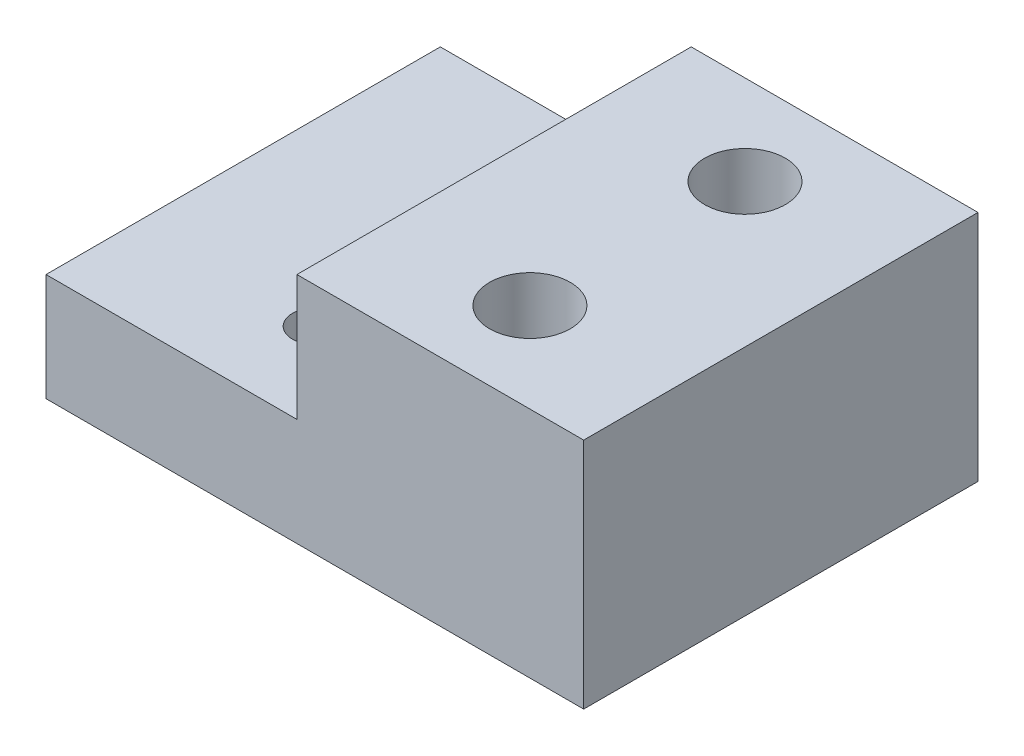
ISO-10303-21;
HEADER;
FILE_DESCRIPTION(('STEP AP214'),'2;1');
FILE_NAME('part.step','',(''),(''),'','','');
FILE_SCHEMA(('AUTOMOTIVE_DESIGN { 1 0 10303 214 1 1 1 1 }'));
ENDSEC;
DATA;
#1=APPLICATION_CONTEXT('core data for automotive mechanical design processes');
#2=APPLICATION_PROTOCOL_DEFINITION('international standard','automotive_design',2000,#1);
#3=PRODUCT_CONTEXT('',#1,'mechanical');
#4=PRODUCT('Part','Part','',(#3));
#5=PRODUCT_RELATED_PRODUCT_CATEGORY('part','',(#4));
#6=PRODUCT_DEFINITION_FORMATION('','',#4);
#7=PRODUCT_DEFINITION_CONTEXT('part definition',#1,'design');
#8=PRODUCT_DEFINITION('design','',#6,#7);
#9=PRODUCT_DEFINITION_SHAPE('','',#8);
#10=(LENGTH_UNIT() NAMED_UNIT(*) SI_UNIT(.MILLI.,.METRE.));
#11=(NAMED_UNIT(*) PLANE_ANGLE_UNIT() SI_UNIT($,.RADIAN.));
#12=(NAMED_UNIT(*) SI_UNIT($,.STERADIAN.) SOLID_ANGLE_UNIT());
#13=UNCERTAINTY_MEASURE_WITH_UNIT(LENGTH_MEASURE(1.E-05),#10,'distance_accuracy_value','');
#14=(GEOMETRIC_REPRESENTATION_CONTEXT(3) GLOBAL_UNCERTAINTY_ASSIGNED_CONTEXT((#13)) GLOBAL_UNIT_ASSIGNED_CONTEXT((#10,
#11,#12)) REPRESENTATION_CONTEXT('',''));
#15=CARTESIAN_POINT('',(0.,0.,0.));
#16=DIRECTION('',(0.,0.,1.));
#17=DIRECTION('',(1.,0.,0.));
#18=AXIS2_PLACEMENT_3D('',#15,#16,#17);
#19=CARTESIAN_POINT('',(-8.00000000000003,3.33066907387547E-13,-17.0000000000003));
#20=DIRECTION('',(0.,1.,0.));
#21=DIRECTION('',(-0.999999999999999,0.,0.));
#22=AXIS2_PLACEMENT_3D('',#19,#20,#21);
#23=CYLINDRICAL_SURFACE('',#22,2.25);
#24=CARTESIAN_POINT('',(-8.00000000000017,12.9999999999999,-17.0000000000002));
#25=DIRECTION('',(0.,1.,0.));
#26=DIRECTION('',(-0.999999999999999,0.,0.));
#27=AXIS2_PLACEMENT_3D('',#24,#25,#26);
#28=CIRCLE('',#27,2.25);
#29=CARTESIAN_POINT('',(-10.25,12.9999999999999,-17.0000000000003));
#30=VERTEX_POINT('',#29);
#31=EDGE_CURVE('E200',#30,#30,#28,.T.);
#32=CARTESIAN_POINT('',(-8.00000000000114,5.49999999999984,-17.0000000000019));
#33=DIRECTION('',(0.,-0.999999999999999,0.));
#34=DIRECTION('',(0.,0.,-0.999999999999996));
#35=AXIS2_PLACEMENT_3D('',#32,#33,#34);
#36=CIRCLE('',#35,2.25);
#37=CARTESIAN_POINT('',(-10.25,5.49999999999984,-17.0000000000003));
#38=VERTEX_POINT('',#37);
#39=EDGE_CURVE('E155',#38,#38,#36,.F.);
#40=CARTESIAN_POINT('',(-10.25,12.9999999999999,-17.0000000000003));
#41=CARTESIAN_POINT('',(-10.25,12.9218749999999,-17.0000000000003));
#42=CARTESIAN_POINT('',(-10.25,12.8437499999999,-17.0000000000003));
#43=CARTESIAN_POINT('',(-10.25,12.6874999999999,-17.0000000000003));
#44=CARTESIAN_POINT('',(-10.25,12.6093749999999,-17.0000000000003));
#45=CARTESIAN_POINT('',(-10.25,12.4531249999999,-17.0000000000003));
#46=CARTESIAN_POINT('',(-10.25,12.3749999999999,-17.0000000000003));
#47=CARTESIAN_POINT('',(-10.25,12.2187499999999,-17.0000000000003));
#48=CARTESIAN_POINT('',(-10.25,12.1406249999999,-17.0000000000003));
#49=CARTESIAN_POINT('',(-10.25,11.9843749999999,-17.0000000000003));
#50=CARTESIAN_POINT('',(-10.25,11.9062499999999,-17.0000000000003));
#51=CARTESIAN_POINT('',(-10.25,11.7499999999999,-17.0000000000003));
#52=CARTESIAN_POINT('',(-10.25,11.6718749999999,-17.0000000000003));
#53=CARTESIAN_POINT('',(-10.25,11.5156249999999,-17.0000000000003));
#54=CARTESIAN_POINT('',(-10.25,11.4374999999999,-17.0000000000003));
#55=CARTESIAN_POINT('',(-10.25,11.2812499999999,-17.0000000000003));
#56=CARTESIAN_POINT('',(-10.25,11.2031249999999,-17.0000000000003));
#57=CARTESIAN_POINT('',(-10.25,11.0468749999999,-17.0000000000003));
#58=CARTESIAN_POINT('',(-10.25,10.9687499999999,-17.0000000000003));
#59=CARTESIAN_POINT('',(-10.25,10.8124999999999,-17.0000000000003));
#60=CARTESIAN_POINT('',(-10.25,10.7343749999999,-17.0000000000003));
#61=CARTESIAN_POINT('',(-10.25,10.5781249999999,-17.0000000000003));
#62=CARTESIAN_POINT('',(-10.25,10.4999999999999,-17.0000000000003));
#63=CARTESIAN_POINT('',(-10.25,10.3437499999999,-17.0000000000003));
#64=CARTESIAN_POINT('',(-10.25,10.2656249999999,-17.0000000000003));
#65=CARTESIAN_POINT('',(-10.25,10.1093749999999,-17.0000000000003));
#66=CARTESIAN_POINT('',(-10.25,10.0312499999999,-17.0000000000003));
#67=CARTESIAN_POINT('',(-10.25,9.87499999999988,-17.0000000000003));
#68=CARTESIAN_POINT('',(-10.25,9.79687499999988,-17.0000000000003));
#69=CARTESIAN_POINT('',(-10.25,9.64062499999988,-17.0000000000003));
#70=CARTESIAN_POINT('',(-10.25,9.56249999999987,-17.0000000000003));
#71=CARTESIAN_POINT('',(-10.25,9.40624999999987,-17.0000000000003));
#72=CARTESIAN_POINT('',(-10.25,9.32812499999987,-17.0000000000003));
#73=CARTESIAN_POINT('',(-10.25,9.17187499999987,-17.0000000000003));
#74=CARTESIAN_POINT('',(-10.25,9.09374999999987,-17.0000000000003));
#75=CARTESIAN_POINT('',(-10.25,8.93749999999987,-17.0000000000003));
#76=CARTESIAN_POINT('',(-10.25,8.85937499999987,-17.0000000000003));
#77=CARTESIAN_POINT('',(-10.25,8.70312499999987,-17.0000000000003));
#78=CARTESIAN_POINT('',(-10.25,8.62499999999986,-17.0000000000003));
#79=CARTESIAN_POINT('',(-10.25,8.46874999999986,-17.0000000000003));
#80=CARTESIAN_POINT('',(-10.25,8.39062499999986,-17.0000000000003));
#81=CARTESIAN_POINT('',(-10.25,8.23437499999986,-17.0000000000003));
#82=CARTESIAN_POINT('',(-10.25,8.15624999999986,-17.0000000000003));
#83=CARTESIAN_POINT('',(-10.25,7.99999999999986,-17.0000000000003));
#84=CARTESIAN_POINT('',(-10.25,7.92187499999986,-17.0000000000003));
#85=CARTESIAN_POINT('',(-10.25,7.76562499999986,-17.0000000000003));
#86=CARTESIAN_POINT('',(-10.25,7.68749999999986,-17.0000000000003));
#87=CARTESIAN_POINT('',(-10.25,7.53124999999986,-17.0000000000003));
#88=CARTESIAN_POINT('',(-10.25,7.45312499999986,-17.0000000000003));
#89=CARTESIAN_POINT('',(-10.25,7.29687499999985,-17.0000000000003));
#90=CARTESIAN_POINT('',(-10.25,7.21874999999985,-17.0000000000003));
#91=CARTESIAN_POINT('',(-10.25,7.06249999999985,-17.0000000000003));
#92=CARTESIAN_POINT('',(-10.25,6.98437499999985,-17.0000000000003));
#93=CARTESIAN_POINT('',(-10.25,6.82812499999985,-17.0000000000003));
#94=CARTESIAN_POINT('',(-10.25,6.74999999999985,-17.0000000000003));
#95=CARTESIAN_POINT('',(-10.25,6.59374999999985,-17.0000000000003));
#96=CARTESIAN_POINT('',(-10.25,6.51562499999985,-17.0000000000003));
#97=CARTESIAN_POINT('',(-10.25,6.35937499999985,-17.0000000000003));
#98=CARTESIAN_POINT('',(-10.25,6.28124999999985,-17.0000000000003));
#99=CARTESIAN_POINT('',(-10.25,6.12499999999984,-17.0000000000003));
#100=CARTESIAN_POINT('',(-10.25,6.04687499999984,-17.0000000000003));
#101=CARTESIAN_POINT('',(-10.25,5.89062499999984,-17.0000000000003));
#102=CARTESIAN_POINT('',(-10.25,5.81249999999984,-17.0000000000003));
#103=CARTESIAN_POINT('',(-10.25,5.65624999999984,-17.0000000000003));
#104=CARTESIAN_POINT('',(-10.25,5.57812499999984,-17.0000000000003));
#105=CARTESIAN_POINT('',(-10.25,5.49999999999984,-17.0000000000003));
#106=B_SPLINE_CURVE_WITH_KNOTS('',3,(#40,#41,#42,#43,#44,#45,#46,#47,#48,#49,#50,#51,#52,#53,
#54,#55,#56,#57,#58,#59,#60,#61,#62,#63,#64,#65,#66,#67,#68,#69,#70,#71,#72,#73,#74,#75,#76,#77,
#78,#79,#80,#81,#82,#83,#84,#85,#86,#87,#88,#89,#90,#91,#92,#93,#94,#95,#96,#97,#98,#99,#100,
#101,#102,#103,#104,#105),.UNSPECIFIED.,.F.,.F.,(4,2,2,2,2,2,2,2,2,2,2,2,2,2,2,2,2,2,2,2,2,2,2,
2,2,2,2,2,2,2,2,2,4),(0.,0.234375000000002,0.468750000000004,0.703125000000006,
0.937500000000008,1.17187500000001,1.40625000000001,1.64062500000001,1.87500000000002,
2.10937500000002,2.34375000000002,2.57812500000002,2.81250000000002,3.04687500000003,
3.28125000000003,3.51562500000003,3.75000000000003,3.98437500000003,4.21875000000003,
4.45312500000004,4.68750000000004,4.92187500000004,5.15625000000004,5.39062500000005,
5.62500000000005,5.85937500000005,6.09375000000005,6.32812500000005,6.56250000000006,
6.79687500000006,7.03125000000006,7.26562500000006,7.50000000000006),.UNSPECIFIED.);
#107=EDGE_CURVE('BSEAM38',#30,#38,#106,.T.);
#108=ORIENTED_EDGE('',*,*,#31,.T.);
#109=ORIENTED_EDGE('',*,*,#39,.F.);
#110=ORIENTED_EDGE('',*,*,#107,.T.);
#111=ORIENTED_EDGE('',*,*,#107,.F.);
#112=EDGE_LOOP('',(#108,#110,#109,#111));
#113=FACE_BOUND('',#112,.T.);
#114=ADVANCED_FACE('F38',(#113),#23,.F.);
#115=CARTESIAN_POINT('',(-8.00000000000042,2.22044604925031E-13,-5.00000000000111));
#116=DIRECTION('',(0.,1.,0.));
#117=DIRECTION('',(-0.999999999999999,0.,0.));
#118=AXIS2_PLACEMENT_3D('',#115,#116,#117);
#119=CYLINDRICAL_SURFACE('',#118,2.25);
#120=CARTESIAN_POINT('',(-8.0000000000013,12.9999999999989,-5.00000000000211));
#121=DIRECTION('',(0.,1.,0.));
#122=DIRECTION('',(-0.999999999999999,0.,0.));
#123=AXIS2_PLACEMENT_3D('',#120,#121,#122);
#124=CIRCLE('',#123,2.25);
#125=CARTESIAN_POINT('',(-10.2500000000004,12.9999999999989,-5.00000000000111));
#126=VERTEX_POINT('',#125);
#127=EDGE_CURVE('E153',#126,#126,#124,.T.);
#128=CARTESIAN_POINT('',(-8.00000000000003,5.49999999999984,-5.00000000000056));
#129=DIRECTION('',(0.,-0.999999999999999,0.));
#130=DIRECTION('',(0.,0.,-0.999999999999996));
#131=AXIS2_PLACEMENT_3D('',#128,#129,#130);
#132=CIRCLE('',#131,2.25);
#133=CARTESIAN_POINT('',(-10.2500000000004,5.49999999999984,-5.00000000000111));
#134=VERTEX_POINT('',#133);
#135=EDGE_CURVE('E150',#134,#134,#132,.F.);
#136=CARTESIAN_POINT('',(-10.2500000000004,12.9999999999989,-5.00000000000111));
#137=CARTESIAN_POINT('',(-10.2500000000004,12.9218749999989,-5.00000000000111));
#138=CARTESIAN_POINT('',(-10.2500000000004,12.8437499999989,-5.00000000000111));
#139=CARTESIAN_POINT('',(-10.2500000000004,12.6874999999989,-5.00000000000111));
#140=CARTESIAN_POINT('',(-10.2500000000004,12.6093749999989,-5.00000000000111));
#141=CARTESIAN_POINT('',(-10.2500000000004,12.453124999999,-5.00000000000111));
#142=CARTESIAN_POINT('',(-10.2500000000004,12.374999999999,-5.00000000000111));
#143=CARTESIAN_POINT('',(-10.2500000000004,12.218749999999,-5.00000000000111));
#144=CARTESIAN_POINT('',(-10.2500000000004,12.140624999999,-5.00000000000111));
#145=CARTESIAN_POINT('',(-10.2500000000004,11.984374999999,-5.00000000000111));
#146=CARTESIAN_POINT('',(-10.2500000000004,11.906249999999,-5.00000000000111));
#147=CARTESIAN_POINT('',(-10.2500000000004,11.7499999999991,-5.00000000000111));
#148=CARTESIAN_POINT('',(-10.2500000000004,11.6718749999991,-5.00000000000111));
#149=CARTESIAN_POINT('',(-10.2500000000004,11.5156249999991,-5.00000000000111));
#150=CARTESIAN_POINT('',(-10.2500000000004,11.4374999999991,-5.00000000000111));
#151=CARTESIAN_POINT('',(-10.2500000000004,11.2812499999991,-5.00000000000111));
#152=CARTESIAN_POINT('',(-10.2500000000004,11.2031249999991,-5.00000000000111));
#153=CARTESIAN_POINT('',(-10.2500000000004,11.0468749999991,-5.00000000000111));
#154=CARTESIAN_POINT('',(-10.2500000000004,10.9687499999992,-5.00000000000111));
#155=CARTESIAN_POINT('',(-10.2500000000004,10.8124999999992,-5.00000000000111));
#156=CARTESIAN_POINT('',(-10.2500000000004,10.7343749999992,-5.00000000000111));
#157=CARTESIAN_POINT('',(-10.2500000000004,10.5781249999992,-5.00000000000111));
#158=CARTESIAN_POINT('',(-10.2500000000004,10.4999999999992,-5.00000000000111));
#159=CARTESIAN_POINT('',(-10.2500000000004,10.3437499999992,-5.00000000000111));
#160=CARTESIAN_POINT('',(-10.2500000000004,10.2656249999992,-5.00000000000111));
#161=CARTESIAN_POINT('',(-10.2500000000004,10.1093749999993,-5.00000000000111));
#162=CARTESIAN_POINT('',(-10.2500000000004,10.0312499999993,-5.00000000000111));
#163=CARTESIAN_POINT('',(-10.2500000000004,9.87499999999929,-5.00000000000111));
#164=CARTESIAN_POINT('',(-10.2500000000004,9.7968749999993,-5.00000000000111));
#165=CARTESIAN_POINT('',(-10.2500000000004,9.64062499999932,-5.00000000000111));
#166=CARTESIAN_POINT('',(-10.2500000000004,9.56249999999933,-5.00000000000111));
#167=CARTESIAN_POINT('',(-10.2500000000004,9.40624999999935,-5.00000000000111));
#168=CARTESIAN_POINT('',(-10.2500000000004,9.32812499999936,-5.00000000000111));
#169=CARTESIAN_POINT('',(-10.2500000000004,9.17187499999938,-5.00000000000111));
#170=CARTESIAN_POINT('',(-10.2500000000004,9.09374999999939,-5.00000000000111));
#171=CARTESIAN_POINT('',(-10.2500000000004,8.93749999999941,-5.00000000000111));
#172=CARTESIAN_POINT('',(-10.2500000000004,8.85937499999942,-5.00000000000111));
#173=CARTESIAN_POINT('',(-10.2500000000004,8.70312499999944,-5.00000000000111));
#174=CARTESIAN_POINT('',(-10.2500000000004,8.62499999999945,-5.00000000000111));
#175=CARTESIAN_POINT('',(-10.2500000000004,8.46874999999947,-5.00000000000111));
#176=CARTESIAN_POINT('',(-10.2500000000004,8.39062499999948,-5.00000000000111));
#177=CARTESIAN_POINT('',(-10.2500000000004,8.2343749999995,-5.00000000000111));
#178=CARTESIAN_POINT('',(-10.2500000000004,8.15624999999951,-5.00000000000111));
#179=CARTESIAN_POINT('',(-10.2500000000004,7.99999999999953,-5.00000000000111));
#180=CARTESIAN_POINT('',(-10.2500000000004,7.92187499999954,-5.00000000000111));
#181=CARTESIAN_POINT('',(-10.2500000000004,7.76562499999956,-5.00000000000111));
#182=CARTESIAN_POINT('',(-10.2500000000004,7.68749999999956,-5.00000000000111));
#183=CARTESIAN_POINT('',(-10.2500000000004,7.53124999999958,-5.00000000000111));
#184=CARTESIAN_POINT('',(-10.2500000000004,7.45312499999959,-5.00000000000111));
#185=CARTESIAN_POINT('',(-10.2500000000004,7.29687499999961,-5.00000000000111));
#186=CARTESIAN_POINT('',(-10.2500000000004,7.21874999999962,-5.00000000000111));
#187=CARTESIAN_POINT('',(-10.2500000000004,7.06249999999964,-5.00000000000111));
#188=CARTESIAN_POINT('',(-10.2500000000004,6.98437499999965,-5.00000000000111));
#189=CARTESIAN_POINT('',(-10.2500000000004,6.82812499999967,-5.00000000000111));
#190=CARTESIAN_POINT('',(-10.2500000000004,6.74999999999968,-5.00000000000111));
#191=CARTESIAN_POINT('',(-10.2500000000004,6.5937499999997,-5.00000000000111));
#192=CARTESIAN_POINT('',(-10.2500000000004,6.51562499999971,-5.00000000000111));
#193=CARTESIAN_POINT('',(-10.2500000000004,6.35937499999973,-5.00000000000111));
#194=CARTESIAN_POINT('',(-10.2500000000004,6.28124999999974,-5.00000000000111));
#195=CARTESIAN_POINT('',(-10.2500000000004,6.12499999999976,-5.00000000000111));
#196=CARTESIAN_POINT('',(-10.2500000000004,6.04687499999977,-5.00000000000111));
#197=CARTESIAN_POINT('',(-10.2500000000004,5.89062499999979,-5.00000000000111));
#198=CARTESIAN_POINT('',(-10.2500000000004,5.8124999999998,-5.00000000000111));
#199=CARTESIAN_POINT('',(-10.2500000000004,5.65624999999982,-5.00000000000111));
#200=CARTESIAN_POINT('',(-10.2500000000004,5.57812499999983,-5.00000000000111));
#201=CARTESIAN_POINT('',(-10.2500000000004,5.49999999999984,-5.00000000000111));
#202=B_SPLINE_CURVE_WITH_KNOTS('',3,(#136,#137,#138,#139,#140,#141,#142,#143,#144,#145,#146,
#147,#148,#149,#150,#151,#152,#153,#154,#155,#156,#157,#158,#159,#160,#161,#162,#163,#164,#165,
#166,#167,#168,#169,#170,#171,#172,#173,#174,#175,#176,#177,#178,#179,#180,#181,#182,#183,#184,
#185,#186,#187,#188,#189,#190,#191,#192,#193,#194,#195,#196,#197,#198,#199,#200,#201),
.UNSPECIFIED.,.F.,.F.,(4,2,2,2,2,2,2,2,2,2,2,2,2,2,2,2,2,2,2,2,2,2,2,2,2,2,2,2,2,2,2,2,4),(0.,
0.234374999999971,0.468749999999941,0.703124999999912,0.937499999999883,1.17187499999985,
1.40624999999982,1.6406249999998,1.87499999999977,2.10937499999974,2.34374999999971,
2.57812499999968,2.81249999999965,3.04687499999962,3.28124999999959,3.51562499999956,
3.74999999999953,3.9843749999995,4.21874999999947,4.45312499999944,4.68749999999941,
4.92187499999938,5.15624999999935,5.39062499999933,5.6249999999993,5.85937499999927,
6.09374999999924,6.32812499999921,6.56249999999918,6.79687499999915,7.03124999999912,
7.26562499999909,7.49999999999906),.UNSPECIFIED.);
#203=EDGE_CURVE('BSEAM225',#126,#134,#202,.T.);
#204=ORIENTED_EDGE('',*,*,#127,.T.);
#205=ORIENTED_EDGE('',*,*,#135,.F.);
#206=ORIENTED_EDGE('',*,*,#203,.T.);
#207=ORIENTED_EDGE('',*,*,#203,.F.);
#208=EDGE_LOOP('',(#204,#206,#205,#207));
#209=FACE_BOUND('',#208,.T.);
#210=ADVANCED_FACE('F225',(#209),#119,.F.);
#211=CARTESIAN_POINT('',(-30.0000000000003,6.00000000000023,-22.0000000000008));
#212=DIRECTION('',(-1.,0.,0.));
#213=DIRECTION('',(0.,0.,0.999999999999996));
#214=AXIS2_PLACEMENT_3D('',#211,#212,#213);
#215=PLANE('',#214);
#216=DIRECTION('',(0.,-0.999999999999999,0.));
#217=VECTOR('',#216,1.);
#218=CARTESIAN_POINT('',(-30.0000000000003,6.00000000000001,-4.44089209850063E-13));
#219=LINE('',#218,#217);
#220=CARTESIAN_POINT('',(-30.0000000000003,6.00000000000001,-4.44089209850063E-13));
#221=VERTEX_POINT('',#220);
#222=CARTESIAN_POINT('',(-30.0000000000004,2.22044604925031E-13,-7.7715611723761E-13));
#223=VERTEX_POINT('',#222);
#224=EDGE_CURVE('E126',#221,#223,#219,.T.);
#225=ORIENTED_EDGE('',*,*,#224,.F.);
#226=DIRECTION('',(0.,0.,0.999999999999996));
#227=VECTOR('',#226,1.);
#228=CARTESIAN_POINT('',(-30.0000000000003,6.00000000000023,-22.0000000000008));
#229=LINE('',#228,#227);
#230=CARTESIAN_POINT('',(-30.0000000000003,6.00000000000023,-22.0000000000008));
#231=VERTEX_POINT('',#230);
#232=EDGE_CURVE('E55',#231,#221,#229,.T.);
#233=ORIENTED_EDGE('',*,*,#232,.F.);
#234=DIRECTION('',(0.,-0.999999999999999,0.));
#235=VECTOR('',#234,1.);
#236=CARTESIAN_POINT('',(-30.0000000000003,6.00000000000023,-22.0000000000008));
#237=LINE('',#236,#235);
#238=CARTESIAN_POINT('',(-30.0000000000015,1.11022302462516E-13,-22.0000000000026));
#239=VERTEX_POINT('',#238);
#240=EDGE_CURVE('E142',#231,#239,#237,.T.);
#241=ORIENTED_EDGE('',*,*,#240,.T.);
#242=DIRECTION('',(0.,0.,0.999999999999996));
#243=VECTOR('',#242,1.);
#244=CARTESIAN_POINT('',(-30.0000000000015,1.11022302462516E-13,-22.0000000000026));
#245=LINE('',#244,#243);
#246=EDGE_CURVE('E90',#239,#223,#245,.T.);
#247=ORIENTED_EDGE('',*,*,#246,.T.);
#248=EDGE_LOOP('',(#225,#233,#241,#247));
#249=FACE_BOUND('',#248,.T.);
#250=ADVANCED_FACE('F192',(#249),#215,.T.);
#251=CARTESIAN_POINT('',(-16.,5.99999999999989,-22.0000000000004));
#252=DIRECTION('',(0.,0.999999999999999,0.));
#253=DIRECTION('',(-0.999999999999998,0.,0.));
#254=AXIS2_PLACEMENT_3D('',#251,#252,#253);
#255=PLANE('',#254);
#256=CARTESIAN_POINT('',(-20.0000000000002,6.00000000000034,-5.00000000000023));
#257=DIRECTION('',(0.,0.999999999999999,0.));
#258=DIRECTION('',(0.,0.,0.999999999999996));
#259=AXIS2_PLACEMENT_3D('',#256,#257,#258);
#260=CIRCLE('',#259,1.24999999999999);
#261=CARTESIAN_POINT('',(-20.0000000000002,6.00000000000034,-3.75000000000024));
#262=VERTEX_POINT('',#261);
#263=EDGE_CURVE('E197',#262,#262,#260,.T.);
#264=ORIENTED_EDGE('',*,*,#263,.F.);
#265=EDGE_LOOP('',(#264));
#266=FACE_BOUND('',#265,.T.);
#267=CARTESIAN_POINT('',(-20.0000000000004,6.00000000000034,-17.0000000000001));
#268=DIRECTION('',(0.,0.999999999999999,0.));
#269=DIRECTION('',(0.,0.,0.999999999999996));
#270=AXIS2_PLACEMENT_3D('',#267,#268,#269);
#271=CIRCLE('',#270,1.24999999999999);
#272=CARTESIAN_POINT('',(-20.0000000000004,6.00000000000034,-15.7500000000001));
#273=VERTEX_POINT('',#272);
#274=EDGE_CURVE('E130',#273,#273,#271,.T.);
#275=ORIENTED_EDGE('',*,*,#274,.F.);
#276=EDGE_LOOP('',(#275));
#277=FACE_BOUND('',#276,.T.);
#278=DIRECTION('',(-0.999999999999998,0.,0.));
#279=VECTOR('',#278,1.);
#280=CARTESIAN_POINT('',(-16.000000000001,5.99999999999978,-1.22124532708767E-12));
#281=LINE('',#280,#279);
#282=CARTESIAN_POINT('',(-16.000000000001,5.99999999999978,-1.22124532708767E-12));
#283=VERTEX_POINT('',#282);
#284=EDGE_CURVE('E139',#283,#221,#281,.T.);
#285=ORIENTED_EDGE('',*,*,#284,.F.);
#286=DIRECTION('',(0.,0.,0.999999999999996));
#287=VECTOR('',#286,1.);
#288=CARTESIAN_POINT('',(-16.,5.99999999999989,-22.0000000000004));
#289=LINE('',#288,#287);
#290=CARTESIAN_POINT('',(-16.,5.99999999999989,-22.0000000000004));
#291=VERTEX_POINT('',#290);
#292=EDGE_CURVE('E78',#291,#283,#289,.T.);
#293=ORIENTED_EDGE('',*,*,#292,.F.);
#294=DIRECTION('',(-0.999999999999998,0.,0.));
#295=VECTOR('',#294,1.);
#296=CARTESIAN_POINT('',(-16.,5.99999999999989,-22.0000000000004));
#297=LINE('',#296,#295);
#298=EDGE_CURVE('E116',#291,#231,#297,.T.);
#299=ORIENTED_EDGE('',*,*,#298,.T.);
#300=ORIENTED_EDGE('',*,*,#232,.T.);
#301=EDGE_LOOP('',(#285,#293,#299,#300));
#302=FACE_BOUND('',#301,.T.);
#303=ADVANCED_FACE('F247',(#266,#277,#302),#255,.T.);
#304=CARTESIAN_POINT('',(-16.0000000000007,12.9999999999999,-22.0000000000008));
#305=DIRECTION('',(-1.,0.,0.));
#306=DIRECTION('',(0.,0.,0.999999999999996));
#307=AXIS2_PLACEMENT_3D('',#304,#305,#306);
#308=PLANE('',#307);
#309=DIRECTION('',(0.,-0.999999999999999,0.));
#310=VECTOR('',#309,1.);
#311=CARTESIAN_POINT('',(-16.0000000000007,13.0000000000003,-1.55431223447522E-12));
#312=LINE('',#311,#310);
#313=CARTESIAN_POINT('',(-16.0000000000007,13.0000000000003,-1.55431223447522E-12));
#314=VERTEX_POINT('',#313);
#315=EDGE_CURVE('E103',#314,#283,#312,.T.);
#316=ORIENTED_EDGE('',*,*,#315,.F.);
#317=DIRECTION('',(0.,0.,0.999999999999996));
#318=VECTOR('',#317,1.);
#319=CARTESIAN_POINT('',(-16.0000000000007,12.9999999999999,-22.0000000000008));
#320=LINE('',#319,#318);
#321=CARTESIAN_POINT('',(-16.0000000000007,12.9999999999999,-22.0000000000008));
#322=VERTEX_POINT('',#321);
#323=EDGE_CURVE('E98',#322,#314,#320,.T.);
#324=ORIENTED_EDGE('',*,*,#323,.F.);
#325=DIRECTION('',(0.,-0.999999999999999,0.));
#326=VECTOR('',#325,1.);
#327=CARTESIAN_POINT('',(-16.0000000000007,12.9999999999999,-22.0000000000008));
#328=LINE('',#327,#326);
#329=EDGE_CURVE('E101',#322,#291,#328,.T.);
#330=ORIENTED_EDGE('',*,*,#329,.T.);
#331=ORIENTED_EDGE('',*,*,#292,.T.);
#332=EDGE_LOOP('',(#316,#324,#330,#331));
#333=FACE_BOUND('',#332,.T.);
#334=ADVANCED_FACE('F100',(#333),#308,.T.);
#335=CARTESIAN_POINT('',(-2.42861286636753E-13,13.0000000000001,-22.0000000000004));
#336=DIRECTION('',(0.,1.,0.));
#337=DIRECTION('',(-0.999999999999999,0.,0.));
#338=AXIS2_PLACEMENT_3D('',#335,#336,#337);
#339=PLANE('',#338);
#340=ORIENTED_EDGE('',*,*,#127,.F.);
#341=EDGE_LOOP('',(#340));
#342=FACE_BOUND('',#341,.T.);
#343=ORIENTED_EDGE('',*,*,#31,.F.);
#344=EDGE_LOOP('',(#343));
#345=FACE_BOUND('',#344,.T.);
#346=DIRECTION('',(-0.999999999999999,0.,0.));
#347=VECTOR('',#346,1.);
#348=CARTESIAN_POINT('',(-8.32667268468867E-13,13.0000000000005,-1.11022302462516E-12));
#349=LINE('',#348,#347);
#350=CARTESIAN_POINT('',(-8.32667268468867E-13,13.0000000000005,-1.11022302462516E-12));
#351=VERTEX_POINT('',#350);
#352=EDGE_CURVE('E136',#351,#314,#349,.T.);
#353=ORIENTED_EDGE('',*,*,#352,.F.);
#354=DIRECTION('',(0.,0.,0.999999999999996));
#355=VECTOR('',#354,1.);
#356=CARTESIAN_POINT('',(-2.42861286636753E-13,13.0000000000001,-22.0000000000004));
#357=LINE('',#356,#355);
#358=CARTESIAN_POINT('',(-2.42861286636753E-13,13.0000000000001,-22.0000000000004));
#359=VERTEX_POINT('',#358);
#360=EDGE_CURVE('E108',#359,#351,#357,.T.);
#361=ORIENTED_EDGE('',*,*,#360,.F.);
#362=DIRECTION('',(-0.999999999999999,0.,0.));
#363=VECTOR('',#362,1.);
#364=CARTESIAN_POINT('',(-2.42861286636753E-13,13.0000000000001,-22.0000000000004));
#365=LINE('',#364,#363);
#366=EDGE_CURVE('E114',#359,#322,#365,.T.);
#367=ORIENTED_EDGE('',*,*,#366,.T.);
#368=ORIENTED_EDGE('',*,*,#323,.T.);
#369=EDGE_LOOP('',(#353,#361,#367,#368));
#370=FACE_BOUND('',#369,.T.);
#371=ADVANCED_FACE('F118',(#342,#345,#370),#339,.T.);
#372=CARTESIAN_POINT('',(-3.53883589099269E-13,-1.11022302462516E-13,-22.0000000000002));
#373=DIRECTION('',(1.,0.,0.));
#374=DIRECTION('',(0.,0.,-0.999999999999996));
#375=AXIS2_PLACEMENT_3D('',#372,#373,#374);
#376=PLANE('',#375);
#377=DIRECTION('',(0.,0.999999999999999,0.));
#378=VECTOR('',#377,1.);
#379=CARTESIAN_POINT('',(0.,0.,0.));
#380=LINE('',#379,#378);
#381=CARTESIAN_POINT('',(0.,0.,0.));
#382=VERTEX_POINT('',#381);
#383=EDGE_CURVE('E133',#382,#351,#380,.T.);
#384=ORIENTED_EDGE('',*,*,#383,.F.);
#385=DIRECTION('',(0.,0.,0.999999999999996));
#386=VECTOR('',#385,1.);
#387=CARTESIAN_POINT('',(-3.53883589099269E-13,-1.11022302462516E-13,-22.0000000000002));
#388=LINE('',#387,#386);
#389=CARTESIAN_POINT('',(-3.53883589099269E-13,-1.11022302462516E-13,-22.0000000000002));
#390=VERTEX_POINT('',#389);
#391=EDGE_CURVE('E147',#390,#382,#388,.T.);
#392=ORIENTED_EDGE('',*,*,#391,.F.);
#393=DIRECTION('',(0.,0.999999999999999,0.));
#394=VECTOR('',#393,1.);
#395=CARTESIAN_POINT('',(-3.53883589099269E-13,-1.11022302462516E-13,-22.0000000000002));
#396=LINE('',#395,#394);
#397=EDGE_CURVE('E119',#390,#359,#396,.T.);
#398=ORIENTED_EDGE('',*,*,#397,.T.);
#399=ORIENTED_EDGE('',*,*,#360,.T.);
#400=EDGE_LOOP('',(#384,#392,#398,#399));
#401=FACE_BOUND('',#400,.T.);
#402=ADVANCED_FACE('F179',(#401),#376,.T.);
#403=CARTESIAN_POINT('',(-30.0000000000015,1.11022302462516E-13,-22.0000000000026));
#404=DIRECTION('',(0.,-0.999999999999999,0.));
#405=DIRECTION('',(0.,0.,-0.999999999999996));
#406=AXIS2_PLACEMENT_3D('',#403,#404,#405);
#407=PLANE('',#406);
#408=CARTESIAN_POINT('',(-20.0000000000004,0.,-17.0000000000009));
#409=DIRECTION('',(0.,-0.999999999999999,0.));
#410=DIRECTION('',(0.,0.,-0.999999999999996));
#411=AXIS2_PLACEMENT_3D('',#408,#409,#410);
#412=CIRCLE('',#411,1.74999999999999);
#413=CARTESIAN_POINT('',(-20.0000000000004,0.,-18.7500000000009));
#414=VERTEX_POINT('',#413);
#415=EDGE_CURVE('E162',#414,#414,#412,.F.);
#416=ORIENTED_EDGE('',*,*,#415,.T.);
#417=EDGE_LOOP('',(#416));
#418=FACE_BOUND('',#417,.T.);
#419=CARTESIAN_POINT('',(-20.0000000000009,1.11022302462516E-13,-5.00000000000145));
#420=DIRECTION('',(0.,-0.999999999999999,0.));
#421=DIRECTION('',(0.,0.,-0.999999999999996));
#422=AXIS2_PLACEMENT_3D('',#419,#420,#421);
#423=CIRCLE('',#422,1.75);
#424=CARTESIAN_POINT('',(-20.0000000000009,1.11022302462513E-13,-6.75000000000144));
#425=VERTEX_POINT('',#424);
#426=EDGE_CURVE('E144',#425,#425,#423,.F.);
#427=ORIENTED_EDGE('',*,*,#426,.T.);
#428=EDGE_LOOP('',(#427));
#429=FACE_BOUND('',#428,.T.);
#430=CARTESIAN_POINT('',(-8.00000000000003,3.33066907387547E-13,-17.0000000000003));
#431=DIRECTION('',(0.,-0.999999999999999,0.));
#432=DIRECTION('',(0.,0.,-0.999999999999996));
#433=AXIS2_PLACEMENT_3D('',#430,#431,#432);
#434=CIRCLE('',#433,4.);
#435=CARTESIAN_POINT('',(-8.00000000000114,3.33066907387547E-13,-21.0000000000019));
#436=VERTEX_POINT('',#435);
#437=EDGE_CURVE('E186',#436,#436,#434,.T.);
#438=ORIENTED_EDGE('',*,*,#437,.F.);
#439=EDGE_LOOP('',(#438));
#440=FACE_BOUND('',#439,.T.);
#441=CARTESIAN_POINT('',(-8.00000000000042,2.22044604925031E-13,-5.00000000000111));
#442=DIRECTION('',(0.,-0.999999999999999,0.));
#443=DIRECTION('',(0.,0.,-0.999999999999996));
#444=AXIS2_PLACEMENT_3D('',#441,#442,#443);
#445=CIRCLE('',#444,4.);
#446=CARTESIAN_POINT('',(-8.00000000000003,2.22044604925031E-13,-9.00000000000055));
#447=VERTEX_POINT('',#446);
#448=EDGE_CURVE('E158',#447,#447,#445,.T.);
#449=ORIENTED_EDGE('',*,*,#448,.F.);
#450=EDGE_LOOP('',(#449));
#451=FACE_BOUND('',#450,.T.);
#452=DIRECTION('',(1.,0.,0.));
#453=VECTOR('',#452,1.);
#454=CARTESIAN_POINT('',(-30.0000000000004,2.22044604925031E-13,-7.7715611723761E-13));
#455=LINE('',#454,#453);
#456=EDGE_CURVE('E129',#223,#382,#455,.T.);
#457=ORIENTED_EDGE('',*,*,#456,.F.);
#458=ORIENTED_EDGE('',*,*,#246,.F.);
#459=DIRECTION('',(1.,0.,0.));
#460=VECTOR('',#459,1.);
#461=CARTESIAN_POINT('',(-30.0000000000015,1.11022302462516E-13,-22.0000000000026));
#462=LINE('',#461,#460);
#463=EDGE_CURVE('E121',#239,#390,#462,.T.);
#464=ORIENTED_EDGE('',*,*,#463,.T.);
#465=ORIENTED_EDGE('',*,*,#391,.T.);
#466=EDGE_LOOP('',(#457,#458,#464,#465));
#467=FACE_BOUND('',#466,.T.);
#468=ADVANCED_FACE('F176',(#418,#429,#440,#451,#467),#407,.T.);
#469=CARTESIAN_POINT('',(-3.53883589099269E-13,-1.11022302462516E-13,-22.0000000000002));
#470=DIRECTION('',(0.,0.,0.999999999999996));
#471=DIRECTION('',(1.,0.,0.));
#472=AXIS2_PLACEMENT_3D('',#469,#470,#471);
#473=PLANE('',#472);
#474=ORIENTED_EDGE('',*,*,#240,.F.);
#475=ORIENTED_EDGE('',*,*,#298,.F.);
#476=ORIENTED_EDGE('',*,*,#329,.F.);
#477=ORIENTED_EDGE('',*,*,#366,.F.);
#478=ORIENTED_EDGE('',*,*,#397,.F.);
#479=ORIENTED_EDGE('',*,*,#463,.F.);
#480=EDGE_LOOP('',(#474,#475,#476,#477,#478,#479));
#481=FACE_BOUND('',#480,.T.);
#482=ADVANCED_FACE('F112',(#481),#473,.F.);
#483=CARTESIAN_POINT('',(0.,0.,0.));
#484=DIRECTION('',(0.,0.,0.999999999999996));
#485=DIRECTION('',(1.,0.,0.));
#486=AXIS2_PLACEMENT_3D('',#483,#484,#485);
#487=PLANE('',#486);
#488=ORIENTED_EDGE('',*,*,#224,.T.);
#489=ORIENTED_EDGE('',*,*,#456,.T.);
#490=ORIENTED_EDGE('',*,*,#383,.T.);
#491=ORIENTED_EDGE('',*,*,#352,.T.);
#492=ORIENTED_EDGE('',*,*,#315,.T.);
#493=ORIENTED_EDGE('',*,*,#284,.T.);
#494=EDGE_LOOP('',(#488,#489,#490,#491,#492,#493));
#495=FACE_BOUND('',#494,.T.);
#496=ADVANCED_FACE('F191',(#495),#487,.T.);
#497=CARTESIAN_POINT('',(-20.0000000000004,6.00000000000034,-17.0000000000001));
#498=DIRECTION('',(0.,0.999999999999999,0.));
#499=DIRECTION('',(0.,0.,0.999999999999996));
#500=AXIS2_PLACEMENT_3D('',#497,#498,#499);
#501=CYLINDRICAL_SURFACE('',#500,1.24999999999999);
#502=CARTESIAN_POINT('',(-20.0000000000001,0.500000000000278,-17.0000000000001));
#503=DIRECTION('',(0.,-0.999999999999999,0.));
#504=DIRECTION('',(0.,0.,-0.999999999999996));
#505=AXIS2_PLACEMENT_3D('',#502,#503,#504);
#506=CIRCLE('',#505,1.24999999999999);
#507=CARTESIAN_POINT('',(-20.0000000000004,0.500000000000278,-15.7500000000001));
#508=VERTEX_POINT('',#507);
#509=EDGE_CURVE('E47',#508,#508,#506,.T.);
#510=CARTESIAN_POINT('',(-20.0000000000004,0.500000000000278,-15.7500000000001));
#511=CARTESIAN_POINT('',(-20.0000000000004,0.557291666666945,-15.7500000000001));
#512=CARTESIAN_POINT('',(-20.0000000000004,0.614583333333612,-15.7500000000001));
#513=CARTESIAN_POINT('',(-20.0000000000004,0.729166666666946,-15.7500000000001));
#514=CARTESIAN_POINT('',(-20.0000000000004,0.786458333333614,-15.7500000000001));
#515=CARTESIAN_POINT('',(-20.0000000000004,0.901041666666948,-15.7500000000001));
#516=CARTESIAN_POINT('',(-20.0000000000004,0.958333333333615,-15.7500000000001));
#517=CARTESIAN_POINT('',(-20.0000000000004,1.07291666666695,-15.7500000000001));
#518=CARTESIAN_POINT('',(-20.0000000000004,1.13020833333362,-15.7500000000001));
#519=CARTESIAN_POINT('',(-20.0000000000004,1.24479166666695,-15.7500000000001));
#520=CARTESIAN_POINT('',(-20.0000000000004,1.30208333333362,-15.7500000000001));
#521=CARTESIAN_POINT('',(-20.0000000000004,1.41666666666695,-15.7500000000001));
#522=CARTESIAN_POINT('',(-20.0000000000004,1.47395833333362,-15.7500000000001));
#523=CARTESIAN_POINT('',(-20.0000000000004,1.58854166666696,-15.7500000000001));
#524=CARTESIAN_POINT('',(-20.0000000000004,1.64583333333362,-15.7500000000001));
#525=CARTESIAN_POINT('',(-20.0000000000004,1.76041666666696,-15.7500000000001));
#526=CARTESIAN_POINT('',(-20.0000000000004,1.81770833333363,-15.7500000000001));
#527=CARTESIAN_POINT('',(-20.0000000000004,1.93229166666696,-15.7500000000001));
#528=CARTESIAN_POINT('',(-20.0000000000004,1.98958333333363,-15.7500000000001));
#529=CARTESIAN_POINT('',(-20.0000000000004,2.10416666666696,-15.7500000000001));
#530=CARTESIAN_POINT('',(-20.0000000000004,2.16145833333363,-15.7500000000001));
#531=CARTESIAN_POINT('',(-20.0000000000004,2.27604166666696,-15.7500000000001));
#532=CARTESIAN_POINT('',(-20.0000000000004,2.33333333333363,-15.7500000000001));
#533=CARTESIAN_POINT('',(-20.0000000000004,2.44791666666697,-15.7500000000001));
#534=CARTESIAN_POINT('',(-20.0000000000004,2.50520833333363,-15.7500000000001));
#535=CARTESIAN_POINT('',(-20.0000000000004,2.61979166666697,-15.7500000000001));
#536=CARTESIAN_POINT('',(-20.0000000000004,2.67708333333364,-15.7500000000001));
#537=CARTESIAN_POINT('',(-20.0000000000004,2.79166666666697,-15.7500000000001));
#538=CARTESIAN_POINT('',(-20.0000000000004,2.84895833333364,-15.7500000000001));
#539=CARTESIAN_POINT('',(-20.0000000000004,2.96354166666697,-15.7500000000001));
#540=CARTESIAN_POINT('',(-20.0000000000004,3.02083333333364,-15.7500000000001));
#541=CARTESIAN_POINT('',(-20.0000000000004,3.13541666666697,-15.7500000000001));
#542=CARTESIAN_POINT('',(-20.0000000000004,3.19270833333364,-15.7500000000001));
#543=CARTESIAN_POINT('',(-20.0000000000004,3.30729166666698,-15.7500000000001));
#544=CARTESIAN_POINT('',(-20.0000000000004,3.36458333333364,-15.7500000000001));
#545=CARTESIAN_POINT('',(-20.0000000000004,3.47916666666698,-15.7500000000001));
#546=CARTESIAN_POINT('',(-20.0000000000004,3.53645833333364,-15.7500000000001));
#547=CARTESIAN_POINT('',(-20.0000000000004,3.65104166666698,-15.7500000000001));
#548=CARTESIAN_POINT('',(-20.0000000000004,3.70833333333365,-15.7500000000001));
#549=CARTESIAN_POINT('',(-20.0000000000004,3.82291666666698,-15.7500000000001));
#550=CARTESIAN_POINT('',(-20.0000000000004,3.88020833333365,-15.7500000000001));
#551=CARTESIAN_POINT('',(-20.0000000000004,3.99479166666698,-15.7500000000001));
#552=CARTESIAN_POINT('',(-20.0000000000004,4.05208333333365,-15.7500000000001));
#553=CARTESIAN_POINT('',(-20.0000000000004,4.16666666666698,-15.7500000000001));
#554=CARTESIAN_POINT('',(-20.0000000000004,4.22395833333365,-15.7500000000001));
#555=CARTESIAN_POINT('',(-20.0000000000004,4.33854166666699,-15.7500000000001));
#556=CARTESIAN_POINT('',(-20.0000000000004,4.39583333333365,-15.7500000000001));
#557=CARTESIAN_POINT('',(-20.0000000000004,4.51041666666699,-15.7500000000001));
#558=CARTESIAN_POINT('',(-20.0000000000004,4.56770833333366,-15.7500000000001));
#559=CARTESIAN_POINT('',(-20.0000000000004,4.68229166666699,-15.7500000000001));
#560=CARTESIAN_POINT('',(-20.0000000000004,4.73958333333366,-15.7500000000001));
#561=CARTESIAN_POINT('',(-20.0000000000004,4.85416666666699,-15.7500000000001));
#562=CARTESIAN_POINT('',(-20.0000000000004,4.91145833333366,-15.7500000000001));
#563=CARTESIAN_POINT('',(-20.0000000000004,5.02604166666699,-15.7500000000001));
#564=CARTESIAN_POINT('',(-20.0000000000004,5.08333333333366,-15.7500000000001));
#565=CARTESIAN_POINT('',(-20.0000000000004,5.197916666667,-15.7500000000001));
#566=CARTESIAN_POINT('',(-20.0000000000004,5.25520833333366,-15.7500000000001));
#567=CARTESIAN_POINT('',(-20.0000000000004,5.369791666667,-15.7500000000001));
#568=CARTESIAN_POINT('',(-20.0000000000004,5.42708333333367,-15.7500000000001));
#569=CARTESIAN_POINT('',(-20.0000000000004,5.541666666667,-15.7500000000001));
#570=CARTESIAN_POINT('',(-20.0000000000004,5.59895833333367,-15.7500000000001));
#571=CARTESIAN_POINT('',(-20.0000000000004,5.713541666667,-15.7500000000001));
#572=CARTESIAN_POINT('',(-20.0000000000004,5.77083333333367,-15.7500000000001));
#573=CARTESIAN_POINT('',(-20.0000000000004,5.885416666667,-15.7500000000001));
#574=CARTESIAN_POINT('',(-20.0000000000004,5.94270833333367,-15.7500000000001));
#575=CARTESIAN_POINT('',(-20.0000000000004,6.00000000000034,-15.7500000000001));
#576=B_SPLINE_CURVE_WITH_KNOTS('',3,(#510,#511,#512,#513,#514,#515,#516,#517,#518,#519,#520,
#521,#522,#523,#524,#525,#526,#527,#528,#529,#530,#531,#532,#533,#534,#535,#536,#537,#538,#539,
#540,#541,#542,#543,#544,#545,#546,#547,#548,#549,#550,#551,#552,#553,#554,#555,#556,#557,#558,
#559,#560,#561,#562,#563,#564,#565,#566,#567,#568,#569,#570,#571,#572,#573,#574,#575),
.UNSPECIFIED.,.F.,.F.,(4,2,2,2,2,2,2,2,2,2,2,2,2,2,2,2,2,2,2,2,2,2,2,2,2,2,2,2,2,2,2,2,4),(0.,
0.171875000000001,0.343750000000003,0.515625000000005,0.687500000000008,0.859375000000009,
1.03125000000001,1.20312500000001,1.37500000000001,1.54687500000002,1.71875000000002,
1.89062500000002,2.06250000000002,2.23437500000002,2.40625000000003,2.57812500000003,
2.75000000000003,2.92187500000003,3.09375000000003,3.26562500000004,3.43750000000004,
3.60937500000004,3.78125000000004,3.95312500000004,4.12500000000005,4.29687500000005,
4.46875000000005,4.64062500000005,4.81250000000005,4.98437500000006,5.15625000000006,
5.32812500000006,5.50000000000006),.UNSPECIFIED.);
#577=EDGE_CURVE('BSEAM167',#508,#273,#576,.T.);
#578=ORIENTED_EDGE('',*,*,#509,.T.);
#579=ORIENTED_EDGE('',*,*,#274,.T.);
#580=ORIENTED_EDGE('',*,*,#577,.T.);
#581=ORIENTED_EDGE('',*,*,#577,.F.);
#582=EDGE_LOOP('',(#578,#580,#579,#581));
#583=FACE_BOUND('',#582,.T.);
#584=ADVANCED_FACE('F167',(#583),#501,.F.);
#585=CARTESIAN_POINT('',(-20.0000000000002,6.00000000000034,-5.00000000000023));
#586=DIRECTION('',(0.,0.999999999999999,0.));
#587=DIRECTION('',(0.,0.,0.999999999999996));
#588=AXIS2_PLACEMENT_3D('',#585,#586,#587);
#589=CYLINDRICAL_SURFACE('',#588,1.24999999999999);
#590=CARTESIAN_POINT('',(-20.0000000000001,0.500000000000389,-4.99999999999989));
#591=DIRECTION('',(0.,-0.999999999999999,0.));
#592=DIRECTION('',(0.,0.,-0.999999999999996));
#593=AXIS2_PLACEMENT_3D('',#590,#591,#592);
#594=CIRCLE('',#593,1.24999999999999);
#595=CARTESIAN_POINT('',(-20.0000000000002,0.500000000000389,-3.75000000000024));
#596=VERTEX_POINT('',#595);
#597=EDGE_CURVE('E11',#596,#596,#594,.T.);
#598=CARTESIAN_POINT('',(-20.0000000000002,0.500000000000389,-3.75000000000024));
#599=CARTESIAN_POINT('',(-20.0000000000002,0.557291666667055,-3.75000000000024));
#600=CARTESIAN_POINT('',(-20.0000000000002,0.614583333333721,-3.75000000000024));
#601=CARTESIAN_POINT('',(-20.0000000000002,0.729166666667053,-3.75000000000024));
#602=CARTESIAN_POINT('',(-20.0000000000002,0.786458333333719,-3.75000000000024));
#603=CARTESIAN_POINT('',(-20.0000000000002,0.901041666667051,-3.75000000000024));
#604=CARTESIAN_POINT('',(-20.0000000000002,0.958333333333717,-3.75000000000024));
#605=CARTESIAN_POINT('',(-20.0000000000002,1.07291666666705,-3.75000000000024));
#606=CARTESIAN_POINT('',(-20.0000000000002,1.13020833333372,-3.75000000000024));
#607=CARTESIAN_POINT('',(-20.0000000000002,1.24479166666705,-3.75000000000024));
#608=CARTESIAN_POINT('',(-20.0000000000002,1.30208333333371,-3.75000000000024));
#609=CARTESIAN_POINT('',(-20.0000000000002,1.41666666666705,-3.75000000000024));
#610=CARTESIAN_POINT('',(-20.0000000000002,1.47395833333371,-3.75000000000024));
#611=CARTESIAN_POINT('',(-20.0000000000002,1.58854166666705,-3.75000000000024));
#612=CARTESIAN_POINT('',(-20.0000000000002,1.64583333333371,-3.75000000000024));
#613=CARTESIAN_POINT('',(-20.0000000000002,1.76041666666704,-3.75000000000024));
#614=CARTESIAN_POINT('',(-20.0000000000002,1.81770833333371,-3.75000000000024));
#615=CARTESIAN_POINT('',(-20.0000000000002,1.93229166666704,-3.75000000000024));
#616=CARTESIAN_POINT('',(-20.0000000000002,1.98958333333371,-3.75000000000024));
#617=CARTESIAN_POINT('',(-20.0000000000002,2.10416666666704,-3.75000000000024));
#618=CARTESIAN_POINT('',(-20.0000000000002,2.16145833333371,-3.75000000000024));
#619=CARTESIAN_POINT('',(-20.0000000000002,2.27604166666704,-3.75000000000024));
#620=CARTESIAN_POINT('',(-20.0000000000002,2.33333333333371,-3.75000000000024));
#621=CARTESIAN_POINT('',(-20.0000000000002,2.44791666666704,-3.75000000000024));
#622=CARTESIAN_POINT('',(-20.0000000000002,2.5052083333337,-3.75000000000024));
#623=CARTESIAN_POINT('',(-20.0000000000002,2.61979166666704,-3.75000000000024));
#624=CARTESIAN_POINT('',(-20.0000000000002,2.6770833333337,-3.75000000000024));
#625=CARTESIAN_POINT('',(-20.0000000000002,2.79166666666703,-3.75000000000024));
#626=CARTESIAN_POINT('',(-20.0000000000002,2.8489583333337,-3.75000000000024));
#627=CARTESIAN_POINT('',(-20.0000000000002,2.96354166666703,-3.75000000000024));
#628=CARTESIAN_POINT('',(-20.0000000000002,3.0208333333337,-3.75000000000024));
#629=CARTESIAN_POINT('',(-20.0000000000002,3.13541666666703,-3.75000000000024));
#630=CARTESIAN_POINT('',(-20.0000000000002,3.1927083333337,-3.75000000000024));
#631=CARTESIAN_POINT('',(-20.0000000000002,3.30729166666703,-3.75000000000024));
#632=CARTESIAN_POINT('',(-20.0000000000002,3.3645833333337,-3.75000000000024));
#633=CARTESIAN_POINT('',(-20.0000000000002,3.47916666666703,-3.75000000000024));
#634=CARTESIAN_POINT('',(-20.0000000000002,3.53645833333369,-3.75000000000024));
#635=CARTESIAN_POINT('',(-20.0000000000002,3.65104166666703,-3.75000000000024));
#636=CARTESIAN_POINT('',(-20.0000000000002,3.70833333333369,-3.75000000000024));
#637=CARTESIAN_POINT('',(-20.0000000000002,3.82291666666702,-3.75000000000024));
#638=CARTESIAN_POINT('',(-20.0000000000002,3.88020833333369,-3.75000000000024));
#639=CARTESIAN_POINT('',(-20.0000000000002,3.99479166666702,-3.75000000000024));
#640=CARTESIAN_POINT('',(-20.0000000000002,4.05208333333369,-3.75000000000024));
#641=CARTESIAN_POINT('',(-20.0000000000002,4.16666666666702,-3.75000000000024));
#642=CARTESIAN_POINT('',(-20.0000000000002,4.22395833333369,-3.75000000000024));
#643=CARTESIAN_POINT('',(-20.0000000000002,4.33854166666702,-3.75000000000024));
#644=CARTESIAN_POINT('',(-20.0000000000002,4.39583333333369,-3.75000000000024));
#645=CARTESIAN_POINT('',(-20.0000000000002,4.51041666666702,-3.75000000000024));
#646=CARTESIAN_POINT('',(-20.0000000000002,4.56770833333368,-3.75000000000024));
#647=CARTESIAN_POINT('',(-20.0000000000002,4.68229166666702,-3.75000000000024));
#648=CARTESIAN_POINT('',(-20.0000000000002,4.73958333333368,-3.75000000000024));
#649=CARTESIAN_POINT('',(-20.0000000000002,4.85416666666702,-3.75000000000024));
#650=CARTESIAN_POINT('',(-20.0000000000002,4.91145833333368,-3.75000000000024));
#651=CARTESIAN_POINT('',(-20.0000000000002,5.02604166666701,-3.75000000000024));
#652=CARTESIAN_POINT('',(-20.0000000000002,5.08333333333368,-3.75000000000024));
#653=CARTESIAN_POINT('',(-20.0000000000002,5.19791666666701,-3.75000000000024));
#654=CARTESIAN_POINT('',(-20.0000000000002,5.25520833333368,-3.75000000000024));
#655=CARTESIAN_POINT('',(-20.0000000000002,5.36979166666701,-3.75000000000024));
#656=CARTESIAN_POINT('',(-20.0000000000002,5.42708333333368,-3.75000000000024));
#657=CARTESIAN_POINT('',(-20.0000000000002,5.54166666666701,-3.75000000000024));
#658=CARTESIAN_POINT('',(-20.0000000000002,5.59895833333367,-3.75000000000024));
#659=CARTESIAN_POINT('',(-20.0000000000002,5.71354166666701,-3.75000000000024));
#660=CARTESIAN_POINT('',(-20.0000000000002,5.77083333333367,-3.75000000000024));
#661=CARTESIAN_POINT('',(-20.0000000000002,5.88541666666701,-3.75000000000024));
#662=CARTESIAN_POINT('',(-20.0000000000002,5.94270833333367,-3.75000000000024));
#663=CARTESIAN_POINT('',(-20.0000000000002,6.00000000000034,-3.75000000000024));
#664=B_SPLINE_CURVE_WITH_KNOTS('',3,(#598,#599,#600,#601,#602,#603,#604,#605,#606,#607,#608,
#609,#610,#611,#612,#613,#614,#615,#616,#617,#618,#619,#620,#621,#622,#623,#624,#625,#626,#627,
#628,#629,#630,#631,#632,#633,#634,#635,#636,#637,#638,#639,#640,#641,#642,#643,#644,#645,#646,
#647,#648,#649,#650,#651,#652,#653,#654,#655,#656,#657,#658,#659,#660,#661,#662,#663),
.UNSPECIFIED.,.F.,.F.,(4,2,2,2,2,2,2,2,2,2,2,2,2,2,2,2,2,2,2,2,2,2,2,2,2,2,2,2,2,2,2,2,4),(0.,
0.171874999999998,0.343749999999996,0.515624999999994,0.687499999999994,0.859374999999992,
1.03124999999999,1.20312499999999,1.37499999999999,1.54687499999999,1.71874999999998,
1.89062499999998,2.06249999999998,2.23437499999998,2.40624999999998,2.57812499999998,
2.74999999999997,2.92187499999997,3.09374999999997,3.26562499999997,3.43749999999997,
3.60937499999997,3.78124999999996,3.95312499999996,4.12499999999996,4.29687499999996,
4.46874999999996,4.64062499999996,4.81249999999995,4.98437499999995,5.15624999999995,
5.32812499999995,5.49999999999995),.UNSPECIFIED.);
#665=EDGE_CURVE('BSEAM236',#596,#262,#664,.T.);
#666=ORIENTED_EDGE('',*,*,#597,.T.);
#667=ORIENTED_EDGE('',*,*,#263,.T.);
#668=ORIENTED_EDGE('',*,*,#665,.T.);
#669=ORIENTED_EDGE('',*,*,#665,.F.);
#670=EDGE_LOOP('',(#666,#668,#667,#669));
#671=FACE_BOUND('',#670,.T.);
#672=ADVANCED_FACE('F236',(#671),#589,.F.);
#673=CARTESIAN_POINT('',(-8.00000000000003,5.49999999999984,-5.00000000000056));
#674=DIRECTION('',(0.,-0.999999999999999,0.));
#675=DIRECTION('',(0.,0.,-0.999999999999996));
#676=AXIS2_PLACEMENT_3D('',#673,#674,#675);
#677=PLANE('',#676);
#678=CARTESIAN_POINT('',(-8.00000000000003,5.49999999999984,-5.00000000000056));
#679=DIRECTION('',(0.,-0.999999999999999,0.));
#680=DIRECTION('',(0.,0.,-0.999999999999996));
#681=AXIS2_PLACEMENT_3D('',#678,#679,#680);
#682=CIRCLE('',#681,4.);
#683=CARTESIAN_POINT('',(-8.00000000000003,5.49999999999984,-9.00000000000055));
#684=VERTEX_POINT('',#683);
#685=EDGE_CURVE('E154',#684,#684,#682,.T.);
#686=ORIENTED_EDGE('',*,*,#685,.T.);
#687=EDGE_LOOP('',(#686));
#688=FACE_BOUND('',#687,.T.);
#689=ORIENTED_EDGE('',*,*,#135,.T.);
#690=EDGE_LOOP('',(#689));
#691=FACE_BOUND('',#690,.T.);
#692=ADVANCED_FACE('F239',(#688,#691),#677,.T.);
#693=CARTESIAN_POINT('',(-8.00000000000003,5.49999999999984,-5.00000000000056));
#694=DIRECTION('',(0.,-0.999999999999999,0.));
#695=DIRECTION('',(0.,0.,-0.999999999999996));
#696=AXIS2_PLACEMENT_3D('',#693,#694,#695);
#697=CYLINDRICAL_SURFACE('',#696,4.);
#698=CARTESIAN_POINT('',(-8.00000000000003,5.49999999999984,-9.00000000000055));
#699=CARTESIAN_POINT('',(-8.00000000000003,5.44270833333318,-9.00000000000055));
#700=CARTESIAN_POINT('',(-8.00000000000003,5.38541666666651,-9.00000000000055));
#701=CARTESIAN_POINT('',(-8.00000000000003,5.27083333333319,-9.00000000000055));
#702=CARTESIAN_POINT('',(-8.00000000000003,5.21354166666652,-9.00000000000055));
#703=CARTESIAN_POINT('',(-8.00000000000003,5.0989583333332,-9.00000000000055));
#704=CARTESIAN_POINT('',(-8.00000000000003,5.04166666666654,-9.00000000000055));
#705=CARTESIAN_POINT('',(-8.00000000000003,4.92708333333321,-9.00000000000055));
#706=CARTESIAN_POINT('',(-8.00000000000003,4.86979166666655,-9.00000000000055));
#707=CARTESIAN_POINT('',(-8.00000000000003,4.75520833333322,-9.00000000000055));
#708=CARTESIAN_POINT('',(-8.00000000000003,4.69791666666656,-9.00000000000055));
#709=CARTESIAN_POINT('',(-8.00000000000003,4.58333333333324,-9.00000000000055));
#710=CARTESIAN_POINT('',(-8.00000000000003,4.52604166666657,-9.00000000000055));
#711=CARTESIAN_POINT('',(-8.00000000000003,4.41145833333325,-9.00000000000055));
#712=CARTESIAN_POINT('',(-8.00000000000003,4.35416666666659,-9.00000000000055));
#713=CARTESIAN_POINT('',(-8.00000000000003,4.23958333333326,-9.00000000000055));
#714=CARTESIAN_POINT('',(-8.00000000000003,4.1822916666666,-9.00000000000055));
#715=CARTESIAN_POINT('',(-8.00000000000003,4.06770833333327,-9.00000000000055));
#716=CARTESIAN_POINT('',(-8.00000000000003,4.01041666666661,-9.00000000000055));
#717=CARTESIAN_POINT('',(-8.00000000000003,3.89583333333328,-9.00000000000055));
#718=CARTESIAN_POINT('',(-8.00000000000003,3.83854166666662,-9.00000000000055));
#719=CARTESIAN_POINT('',(-8.00000000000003,3.7239583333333,-9.00000000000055));
#720=CARTESIAN_POINT('',(-8.00000000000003,3.66666666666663,-9.00000000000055));
#721=CARTESIAN_POINT('',(-8.00000000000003,3.55208333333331,-9.00000000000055));
#722=CARTESIAN_POINT('',(-8.00000000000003,3.49479166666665,-9.00000000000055));
#723=CARTESIAN_POINT('',(-8.00000000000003,3.38020833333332,-9.00000000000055));
#724=CARTESIAN_POINT('',(-8.00000000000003,3.32291666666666,-9.00000000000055));
#725=CARTESIAN_POINT('',(-8.00000000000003,3.20833333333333,-9.00000000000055));
#726=CARTESIAN_POINT('',(-8.00000000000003,3.15104166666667,-9.00000000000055));
#727=CARTESIAN_POINT('',(-8.00000000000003,3.03645833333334,-9.00000000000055));
#728=CARTESIAN_POINT('',(-8.00000000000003,2.97916666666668,-9.00000000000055));
#729=CARTESIAN_POINT('',(-8.00000000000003,2.86458333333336,-9.00000000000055));
#730=CARTESIAN_POINT('',(-8.00000000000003,2.80729166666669,-9.00000000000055));
#731=CARTESIAN_POINT('',(-8.00000000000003,2.69270833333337,-9.00000000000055));
#732=CARTESIAN_POINT('',(-8.00000000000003,2.63541666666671,-9.00000000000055));
#733=CARTESIAN_POINT('',(-8.00000000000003,2.52083333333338,-9.00000000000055));
#734=CARTESIAN_POINT('',(-8.00000000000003,2.46354166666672,-9.00000000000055));
#735=CARTESIAN_POINT('',(-8.00000000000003,2.34895833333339,-9.00000000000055));
#736=CARTESIAN_POINT('',(-8.00000000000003,2.29166666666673,-9.00000000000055));
#737=CARTESIAN_POINT('',(-8.00000000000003,2.1770833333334,-9.00000000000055));
#738=CARTESIAN_POINT('',(-8.00000000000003,2.11979166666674,-9.00000000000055));
#739=CARTESIAN_POINT('',(-8.00000000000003,2.00520833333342,-9.00000000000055));
#740=CARTESIAN_POINT('',(-8.00000000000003,1.94791666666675,-9.00000000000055));
#741=CARTESIAN_POINT('',(-8.00000000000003,1.83333333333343,-9.00000000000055));
#742=CARTESIAN_POINT('',(-8.00000000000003,1.77604166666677,-9.00000000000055));
#743=CARTESIAN_POINT('',(-8.00000000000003,1.66145833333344,-9.00000000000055));
#744=CARTESIAN_POINT('',(-8.00000000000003,1.60416666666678,-9.00000000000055));
#745=CARTESIAN_POINT('',(-8.00000000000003,1.48958333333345,-9.00000000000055));
#746=CARTESIAN_POINT('',(-8.00000000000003,1.43229166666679,-9.00000000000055));
#747=CARTESIAN_POINT('',(-8.00000000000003,1.31770833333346,-9.00000000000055));
#748=CARTESIAN_POINT('',(-8.00000000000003,1.2604166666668,-9.00000000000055));
#749=CARTESIAN_POINT('',(-8.00000000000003,1.14583333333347,-9.00000000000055));
#750=CARTESIAN_POINT('',(-8.00000000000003,1.08854166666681,-9.00000000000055));
#751=CARTESIAN_POINT('',(-8.00000000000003,0.973958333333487,-9.00000000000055));
#752=CARTESIAN_POINT('',(-8.00000000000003,0.916666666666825,-9.00000000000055));
#753=CARTESIAN_POINT('',(-8.00000000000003,0.802083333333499,-9.00000000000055));
#754=CARTESIAN_POINT('',(-8.00000000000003,0.744791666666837,-9.00000000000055));
#755=CARTESIAN_POINT('',(-8.00000000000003,0.630208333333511,-9.00000000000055));
#756=CARTESIAN_POINT('',(-8.00000000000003,0.572916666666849,-9.00000000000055));
#757=CARTESIAN_POINT('',(-8.00000000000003,0.458333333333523,-9.00000000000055));
#758=CARTESIAN_POINT('',(-8.00000000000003,0.40104166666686,-9.00000000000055));
#759=CARTESIAN_POINT('',(-8.00000000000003,0.286458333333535,-9.00000000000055));
#760=CARTESIAN_POINT('',(-8.00000000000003,0.229166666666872,-9.00000000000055));
#761=CARTESIAN_POINT('',(-8.00000000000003,0.114583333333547,-9.00000000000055));
#762=CARTESIAN_POINT('',(-8.00000000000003,0.0572916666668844,-9.00000000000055));
#763=CARTESIAN_POINT('',(-8.00000000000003,2.22044604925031E-13,-9.00000000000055));
#764=B_SPLINE_CURVE_WITH_KNOTS('',3,(#698,#699,#700,#701,#702,#703,#704,#705,#706,#707,#708,
#709,#710,#711,#712,#713,#714,#715,#716,#717,#718,#719,#720,#721,#722,#723,#724,#725,#726,#727,
#728,#729,#730,#731,#732,#733,#734,#735,#736,#737,#738,#739,#740,#741,#742,#743,#744,#745,#746,
#747,#748,#749,#750,#751,#752,#753,#754,#755,#756,#757,#758,#759,#760,#761,#762,#763),
.UNSPECIFIED.,.F.,.F.,(4,2,2,2,2,2,2,2,2,2,2,2,2,2,2,2,2,2,2,2,2,2,2,2,2,2,2,2,2,2,2,2,4),(0.,
0.171874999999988,0.343749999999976,0.515624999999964,0.687499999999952,0.85937499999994,
1.03124999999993,1.20312499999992,1.3749999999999,1.54687499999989,1.71874999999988,
1.89062499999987,2.06249999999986,2.23437499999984,2.40624999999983,2.57812499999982,
2.74999999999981,2.9218749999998,3.09374999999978,3.26562499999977,3.43749999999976,
3.60937499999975,3.78124999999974,3.95312499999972,4.12499999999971,4.2968749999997,
4.46874999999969,4.64062499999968,4.81249999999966,4.98437499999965,5.15624999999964,
5.32812499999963,5.49999999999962),.UNSPECIFIED.);
#765=EDGE_CURVE('BSEAM221',#684,#447,#764,.T.);
#766=ORIENTED_EDGE('',*,*,#685,.F.);
#767=ORIENTED_EDGE('',*,*,#448,.T.);
#768=ORIENTED_EDGE('',*,*,#765,.T.);
#769=ORIENTED_EDGE('',*,*,#765,.F.);
#770=EDGE_LOOP('',(#766,#768,#767,#769));
#771=FACE_BOUND('',#770,.T.);
#772=ADVANCED_FACE('F221',(#771),#697,.F.);
#773=CARTESIAN_POINT('',(-8.00000000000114,5.49999999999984,-17.0000000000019));
#774=DIRECTION('',(0.,-0.999999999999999,0.));
#775=DIRECTION('',(0.,0.,-0.999999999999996));
#776=AXIS2_PLACEMENT_3D('',#773,#774,#775);
#777=PLANE('',#776);
#778=CARTESIAN_POINT('',(-8.00000000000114,5.49999999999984,-17.0000000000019));
#779=DIRECTION('',(0.,-0.999999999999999,0.));
#780=DIRECTION('',(0.,0.,-0.999999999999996));
#781=AXIS2_PLACEMENT_3D('',#778,#779,#780);
#782=CIRCLE('',#781,4.);
#783=CARTESIAN_POINT('',(-8.00000000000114,5.49999999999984,-21.0000000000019));
#784=VERTEX_POINT('',#783);
#785=EDGE_CURVE('E159',#784,#784,#782,.T.);
#786=ORIENTED_EDGE('',*,*,#785,.T.);
#787=EDGE_LOOP('',(#786));
#788=FACE_BOUND('',#787,.T.);
#789=ORIENTED_EDGE('',*,*,#39,.T.);
#790=EDGE_LOOP('',(#789));
#791=FACE_BOUND('',#790,.T.);
#792=ADVANCED_FACE('F212',(#788,#791),#777,.T.);
#793=CARTESIAN_POINT('',(-8.00000000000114,5.49999999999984,-17.0000000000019));
#794=DIRECTION('',(0.,-0.999999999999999,0.));
#795=DIRECTION('',(0.,0.,-0.999999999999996));
#796=AXIS2_PLACEMENT_3D('',#793,#794,#795);
#797=CYLINDRICAL_SURFACE('',#796,4.);
#798=CARTESIAN_POINT('',(-8.00000000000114,5.49999999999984,-21.0000000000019));
#799=CARTESIAN_POINT('',(-8.00000000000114,5.44270833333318,-21.0000000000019));
#800=CARTESIAN_POINT('',(-8.00000000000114,5.38541666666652,-21.0000000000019));
#801=CARTESIAN_POINT('',(-8.00000000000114,5.27083333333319,-21.0000000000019));
#802=CARTESIAN_POINT('',(-8.00000000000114,5.21354166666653,-21.0000000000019));
#803=CARTESIAN_POINT('',(-8.00000000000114,5.09895833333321,-21.0000000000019));
#804=CARTESIAN_POINT('',(-8.00000000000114,5.04166666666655,-21.0000000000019));
#805=CARTESIAN_POINT('',(-8.00000000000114,4.92708333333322,-21.0000000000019));
#806=CARTESIAN_POINT('',(-8.00000000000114,4.86979166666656,-21.0000000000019));
#807=CARTESIAN_POINT('',(-8.00000000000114,4.75520833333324,-21.0000000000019));
#808=CARTESIAN_POINT('',(-8.00000000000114,4.69791666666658,-21.0000000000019));
#809=CARTESIAN_POINT('',(-8.00000000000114,4.58333333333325,-21.0000000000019));
#810=CARTESIAN_POINT('',(-8.00000000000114,4.52604166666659,-21.0000000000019));
#811=CARTESIAN_POINT('',(-8.00000000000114,4.41145833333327,-21.0000000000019));
#812=CARTESIAN_POINT('',(-8.00000000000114,4.35416666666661,-21.0000000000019));
#813=CARTESIAN_POINT('',(-8.00000000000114,4.23958333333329,-21.0000000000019));
#814=CARTESIAN_POINT('',(-8.00000000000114,4.18229166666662,-21.0000000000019));
#815=CARTESIAN_POINT('',(-8.00000000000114,4.0677083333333,-21.0000000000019));
#816=CARTESIAN_POINT('',(-8.00000000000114,4.01041666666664,-21.0000000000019));
#817=CARTESIAN_POINT('',(-8.00000000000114,3.89583333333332,-21.0000000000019));
#818=CARTESIAN_POINT('',(-8.00000000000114,3.83854166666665,-21.0000000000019));
#819=CARTESIAN_POINT('',(-8.00000000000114,3.72395833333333,-21.0000000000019));
#820=CARTESIAN_POINT('',(-8.00000000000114,3.66666666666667,-21.0000000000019));
#821=CARTESIAN_POINT('',(-8.00000000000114,3.55208333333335,-21.0000000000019));
#822=CARTESIAN_POINT('',(-8.00000000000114,3.49479166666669,-21.0000000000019));
#823=CARTESIAN_POINT('',(-8.00000000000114,3.38020833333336,-21.0000000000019));
#824=CARTESIAN_POINT('',(-8.00000000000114,3.3229166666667,-21.0000000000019));
#825=CARTESIAN_POINT('',(-8.00000000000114,3.20833333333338,-21.0000000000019));
#826=CARTESIAN_POINT('',(-8.00000000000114,3.15104166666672,-21.0000000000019));
#827=CARTESIAN_POINT('',(-8.00000000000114,3.03645833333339,-21.0000000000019));
#828=CARTESIAN_POINT('',(-8.00000000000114,2.97916666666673,-21.0000000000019));
#829=CARTESIAN_POINT('',(-8.00000000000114,2.86458333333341,-21.0000000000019));
#830=CARTESIAN_POINT('',(-8.00000000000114,2.80729166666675,-21.0000000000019));
#831=CARTESIAN_POINT('',(-8.00000000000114,2.69270833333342,-21.0000000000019));
#832=CARTESIAN_POINT('',(-8.00000000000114,2.63541666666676,-21.0000000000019));
#833=CARTESIAN_POINT('',(-8.00000000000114,2.52083333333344,-21.0000000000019));
#834=CARTESIAN_POINT('',(-8.00000000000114,2.46354166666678,-21.0000000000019));
#835=CARTESIAN_POINT('',(-8.00000000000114,2.34895833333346,-21.0000000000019));
#836=CARTESIAN_POINT('',(-8.00000000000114,2.29166666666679,-21.0000000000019));
#837=CARTESIAN_POINT('',(-8.00000000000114,2.17708333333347,-21.0000000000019));
#838=CARTESIAN_POINT('',(-8.00000000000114,2.11979166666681,-21.0000000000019));
#839=CARTESIAN_POINT('',(-8.00000000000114,2.00520833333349,-21.0000000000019));
#840=CARTESIAN_POINT('',(-8.00000000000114,1.94791666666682,-21.0000000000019));
#841=CARTESIAN_POINT('',(-8.00000000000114,1.8333333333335,-21.0000000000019));
#842=CARTESIAN_POINT('',(-8.00000000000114,1.77604166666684,-21.0000000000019));
#843=CARTESIAN_POINT('',(-8.00000000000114,1.66145833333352,-21.0000000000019));
#844=CARTESIAN_POINT('',(-8.00000000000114,1.60416666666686,-21.0000000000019));
#845=CARTESIAN_POINT('',(-8.00000000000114,1.48958333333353,-21.0000000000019));
#846=CARTESIAN_POINT('',(-8.00000000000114,1.43229166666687,-21.0000000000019));
#847=CARTESIAN_POINT('',(-8.00000000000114,1.31770833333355,-21.0000000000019));
#848=CARTESIAN_POINT('',(-8.00000000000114,1.26041666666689,-21.0000000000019));
#849=CARTESIAN_POINT('',(-8.00000000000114,1.14583333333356,-21.0000000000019));
#850=CARTESIAN_POINT('',(-8.00000000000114,1.0885416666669,-21.0000000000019));
#851=CARTESIAN_POINT('',(-8.00000000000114,0.973958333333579,-21.0000000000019));
#852=CARTESIAN_POINT('',(-8.00000000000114,0.916666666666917,-21.0000000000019));
#853=CARTESIAN_POINT('',(-8.00000000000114,0.802083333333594,-21.0000000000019));
#854=CARTESIAN_POINT('',(-8.00000000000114,0.744791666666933,-21.0000000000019));
#855=CARTESIAN_POINT('',(-8.00000000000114,0.63020833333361,-21.0000000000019));
#856=CARTESIAN_POINT('',(-8.00000000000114,0.572916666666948,-21.0000000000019));
#857=CARTESIAN_POINT('',(-8.00000000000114,0.458333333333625,-21.0000000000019));
#858=CARTESIAN_POINT('',(-8.00000000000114,0.401041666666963,-21.0000000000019));
#859=CARTESIAN_POINT('',(-8.00000000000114,0.28645833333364,-21.0000000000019));
#860=CARTESIAN_POINT('',(-8.00000000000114,0.229166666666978,-21.0000000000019));
#861=CARTESIAN_POINT('',(-8.00000000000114,0.114583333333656,-21.0000000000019));
#862=CARTESIAN_POINT('',(-8.00000000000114,0.0572916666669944,-21.0000000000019));
#863=CARTESIAN_POINT('',(-8.00000000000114,3.33066907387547E-13,-21.0000000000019));
#864=B_SPLINE_CURVE_WITH_KNOTS('',3,(#798,#799,#800,#801,#802,#803,#804,#805,#806,#807,#808,
#809,#810,#811,#812,#813,#814,#815,#816,#817,#818,#819,#820,#821,#822,#823,#824,#825,#826,#827,
#828,#829,#830,#831,#832,#833,#834,#835,#836,#837,#838,#839,#840,#841,#842,#843,#844,#845,#846,
#847,#848,#849,#850,#851,#852,#853,#854,#855,#856,#857,#858,#859,#860,#861,#862,#863),
.UNSPECIFIED.,.F.,.F.,(4,2,2,2,2,2,2,2,2,2,2,2,2,2,2,2,2,2,2,2,2,2,2,2,2,2,2,2,2,2,2,2,4),(0.,
0.171874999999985,0.343749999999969,0.515624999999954,0.687499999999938,0.859374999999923,
1.03124999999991,1.20312499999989,1.37499999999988,1.54687499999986,1.71874999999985,
1.89062499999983,2.06249999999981,2.2343749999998,2.40624999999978,2.57812499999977,
2.74999999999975,2.92187499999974,3.09374999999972,3.26562499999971,3.43749999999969,
3.60937499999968,3.78124999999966,3.95312499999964,4.12499999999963,4.29687499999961,
4.4687499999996,4.64062499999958,4.81249999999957,4.98437499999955,5.15624999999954,
5.32812499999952,5.49999999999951),.UNSPECIFIED.);
#865=EDGE_CURVE('BSEAM173',#784,#436,#864,.T.);
#866=ORIENTED_EDGE('',*,*,#785,.F.);
#867=ORIENTED_EDGE('',*,*,#437,.T.);
#868=ORIENTED_EDGE('',*,*,#865,.T.);
#869=ORIENTED_EDGE('',*,*,#865,.F.);
#870=EDGE_LOOP('',(#866,#868,#867,#869));
#871=FACE_BOUND('',#870,.T.);
#872=ADVANCED_FACE('F173',(#871),#797,.F.);
#873=CARTESIAN_POINT('',(-20.0000000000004,0.,-17.0000000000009));
#874=DIRECTION('',(0.,-0.999999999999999,0.));
#875=DIRECTION('',(0.,0.,-0.999999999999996));
#876=AXIS2_PLACEMENT_3D('',#873,#874,#875);
#877=CONICAL_SURFACE('',#876,1.74999999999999,0.785398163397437);
#878=ORIENTED_EDGE('',*,*,#509,.F.);
#879=EDGE_LOOP('',(#878));
#880=FACE_BOUND('',#879,.T.);
#881=ORIENTED_EDGE('',*,*,#415,.F.);
#882=EDGE_LOOP('',(#881));
#883=FACE_BOUND('',#882,.T.);
#884=ADVANCED_FACE('F170',(#880,#883),#877,.F.);
#885=CARTESIAN_POINT('',(-20.0000000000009,1.11022302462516E-13,-5.00000000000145));
#886=DIRECTION('',(0.,-0.999999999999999,0.));
#887=DIRECTION('',(0.,0.,-0.999999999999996));
#888=AXIS2_PLACEMENT_3D('',#885,#886,#887);
#889=CONICAL_SURFACE('',#888,1.75,0.785398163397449);
#890=ORIENTED_EDGE('',*,*,#597,.F.);
#891=EDGE_LOOP('',(#890));
#892=FACE_BOUND('',#891,.T.);
#893=ORIENTED_EDGE('',*,*,#426,.F.);
#894=EDGE_LOOP('',(#893));
#895=FACE_BOUND('',#894,.T.);
#896=ADVANCED_FACE('F40',(#892,#895),#889,.F.);
#897=CLOSED_SHELL('',(#114,#210,#250,#303,#334,#371,#402,#468,#482,#496,#584,#672,#692,#772,
#792,#872,#884,#896));
#898=MANIFOLD_SOLID_BREP('B2',#897);
#899=ADVANCED_BREP_SHAPE_REPRESENTATION('',(#18,#898),#14);
#900=SHAPE_DEFINITION_REPRESENTATION(#9,#899);
ENDSEC;
END-ISO-10303-21;
